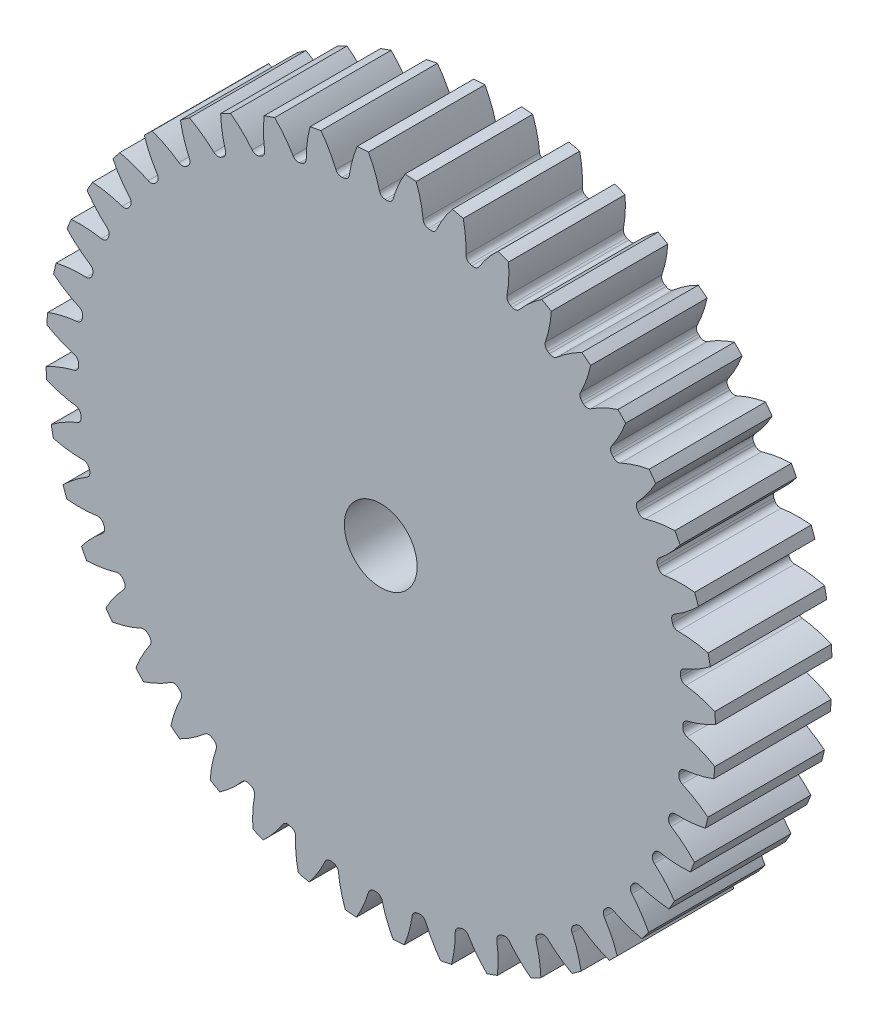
from build123d import *

# Parameters (mm, degrees)
SKETCH3_R         = 292.1
GEARBODY_DEPTH    = 101.6
TOOTHCUT_DEPTH    = 426.402609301
CIRPATTERN1_COUNT = 44
BOREDIA_R         = 31.75
BORE_DEPTH        = 12700


with BuildPart() as part:
    # Sketch3 → gearBody (new body)
    with BuildSketch(Plane.XY):
        Circle(SKETCH3_R)
    extrude(amount=GEARBODY_DEPTH)

    # Sketch2 → toothCut (cut, through all)
    with BuildSketch(Plane.XY):
        with BuildLine():
            ThreePointArc((263.464134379, -5.663525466), (263.482551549, -4.729762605), (263.49765931, -3.795940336))
            ThreePointArc((263.49765931, -3.795940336), (264.614662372, -0.660410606), (267.411686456, 1.144000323))
            ThreePointArc((267.411686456, 1.144000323), (280.07200087, 5.200603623), (292.1, 10.863361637))
            ThreePointArc((292.1, 10.863361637), (292.254853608, -5.246252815), (291.52192025, -21.339930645))
            ThreePointArc((291.52192025, -21.339930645), (279.70490865, -15.249131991), (267.198343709, -10.74075925))
            ThreePointArc((267.198343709, -10.74075925), (264.467882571, -8.8371247), (263.464134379, -5.663525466))
        make_face()
    toothcut = extrude(amount=TOOTHCUT_DEPTH, mode=Mode.SUBTRACT)

    # CirPattern1: toothCut ×44 about axis
    cirpattern1_axis = Axis((0, 0, 0), (0, 0, 1))
    for i in range(1, CIRPATTERN1_COUNT):
        add(toothcut.rotate(cirpattern1_axis, i * 360 / CIRPATTERN1_COUNT), mode=Mode.SUBTRACT)

    # boreDia → bore (cut, symmetric)
    with BuildSketch(Plane.XY):
        Circle(BOREDIA_R)
    extrude(amount=BORE_DEPTH, both=True, mode=Mode.SUBTRACT)


solid = part.part
